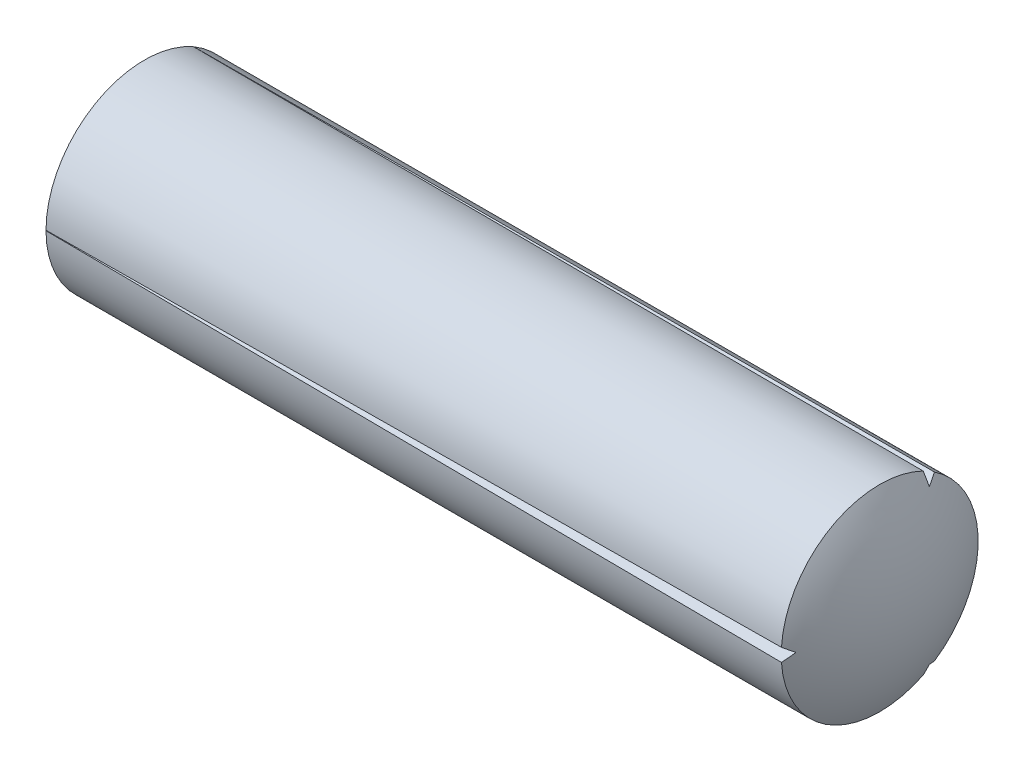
from build123d import *

# Parameters (mm, degrees)
CIRPATTERN1_COUNT = 3


with BuildPart() as part:
    # Sketch1 → Base-Revolve (revolve)
    with BuildSketch(Plane.XY):
        with BuildLine():
            Line((-100, 0), (-100, 1.25))
            ThreePointArc((-100, 1.25), (-99.010050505, 7.072345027), (-96.68190465, 12.5))
            Line((-96.68190465, 12.5), (-3.349364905, 12.5))
            ThreePointArc((-3.349364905, 12.5), (-0.851854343, 6.470476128), (0, 0))
            Line((0, 0), (-100, 0))
        make_face()
    revolve(axis=Axis((-40, 0, 0), (1, 0, 0)))

    # Cut-Sweep1: sweep along a path in Sketch4
    with BuildLine(Plane(origin=(0, 0, 0), x_dir=(1, 0, 0), z_dir=(0, 1, 0))) as cut_sweep1_path:
        Line((0, -11.25), (-100, -12.5))
    # Sketch2 → Cut-Sweep1 (sweep, cut)
    with BuildSketch(Plane(origin=(0, 0, 0), x_dir=(0, 0, -1), z_dir=(1, 0, 0))):
        Polygon((-11.25, 0), (-12.5, 0.875259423), (-12.5, -0.875259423), align=None)
    cut_sweep1 = sweep(path=cut_sweep1_path.line, mode=Mode.SUBTRACT)

    # CirPattern1: Cut-Sweep1 ×3 about axis
    cirpattern1_axis = Axis((0, 0, 0), (1, 0, 0))
    for i in range(1, CIRPATTERN1_COUNT):
        add(cut_sweep1.rotate(cirpattern1_axis, i * 360 / CIRPATTERN1_COUNT), mode=Mode.SUBTRACT)


solid = part.part
